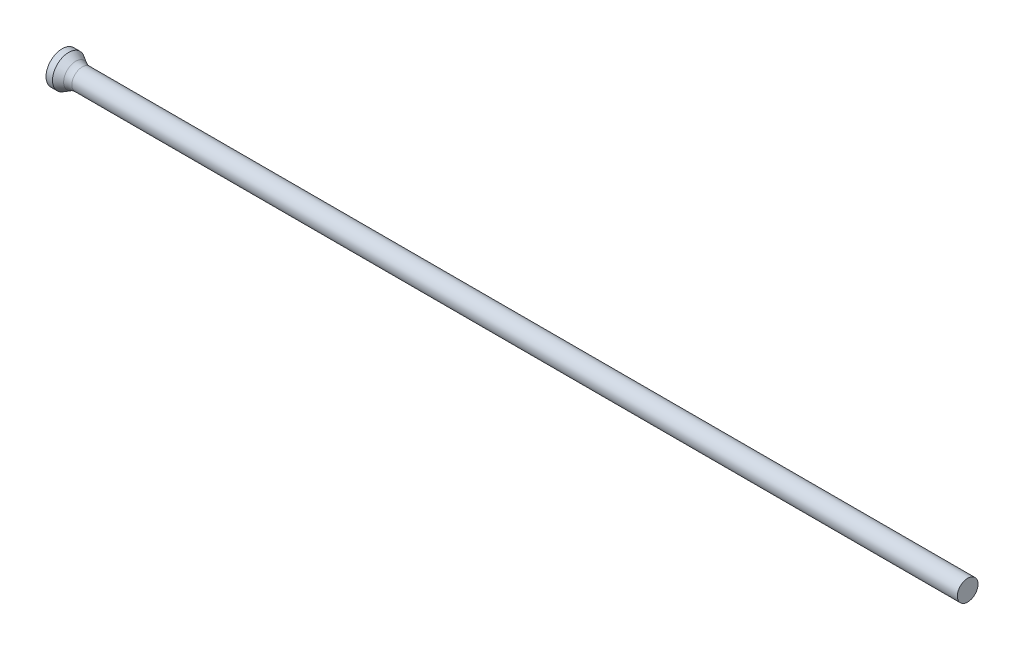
ISO-10303-21;
HEADER;
FILE_DESCRIPTION(('STEP AP214'),'2;1');
FILE_NAME('part.step','',(''),(''),'','','');
FILE_SCHEMA(('AUTOMOTIVE_DESIGN { 1 0 10303 214 1 1 1 1 }'));
ENDSEC;
DATA;
#1=APPLICATION_CONTEXT('core data for automotive mechanical design processes');
#2=APPLICATION_PROTOCOL_DEFINITION('international standard','automotive_design',2000,#1);
#3=PRODUCT_CONTEXT('',#1,'mechanical');
#4=PRODUCT('Part','Part','',(#3));
#5=PRODUCT_RELATED_PRODUCT_CATEGORY('part','',(#4));
#6=PRODUCT_DEFINITION_FORMATION('','',#4);
#7=PRODUCT_DEFINITION_CONTEXT('part definition',#1,'design');
#8=PRODUCT_DEFINITION('design','',#6,#7);
#9=PRODUCT_DEFINITION_SHAPE('','',#8);
#10=(LENGTH_UNIT() NAMED_UNIT(*) SI_UNIT(.MILLI.,.METRE.));
#11=(NAMED_UNIT(*) PLANE_ANGLE_UNIT() SI_UNIT($,.RADIAN.));
#12=(NAMED_UNIT(*) SI_UNIT($,.STERADIAN.) SOLID_ANGLE_UNIT());
#13=UNCERTAINTY_MEASURE_WITH_UNIT(LENGTH_MEASURE(1.E-05),#10,'distance_accuracy_value','');
#14=(GEOMETRIC_REPRESENTATION_CONTEXT(3) GLOBAL_UNCERTAINTY_ASSIGNED_CONTEXT((#13)) GLOBAL_UNIT_ASSIGNED_CONTEXT((#10,
#11,#12)) REPRESENTATION_CONTEXT('',''));
#15=CARTESIAN_POINT('',(0.,0.,0.));
#16=DIRECTION('',(0.,0.,1.));
#17=DIRECTION('',(1.,0.,0.));
#18=AXIS2_PLACEMENT_3D('',#15,#16,#17);
#19=CARTESIAN_POINT('',(0.,0.,0.));
#20=DIRECTION('',(1.,0.,0.));
#21=DIRECTION('',(0.,0.,-1.));
#22=AXIS2_PLACEMENT_3D('',#19,#20,#21);
#23=PLANE('',#22);
#24=CARTESIAN_POINT('',(0.,0.,0.));
#25=DIRECTION('',(-1.,0.,0.));
#26=DIRECTION('',(0.,0.,1.));
#27=AXIS2_PLACEMENT_3D('',#24,#25,#26);
#28=CIRCLE('',#27,1.25);
#29=CARTESIAN_POINT('',(0.,0.,1.25));
#30=VERTEX_POINT('',#29);
#31=EDGE_CURVE('E25',#30,#30,#28,.T.);
#32=ORIENTED_EDGE('',*,*,#31,.T.);
#33=EDGE_LOOP('',(#32));
#34=FACE_BOUND('',#33,.T.);
#35=ADVANCED_FACE('F14',(#34),#23,.F.);
#36=CARTESIAN_POINT('',(0.,0.,0.));
#37=DIRECTION('',(-1.,0.,0.));
#38=DIRECTION('',(0.,0.,1.));
#39=AXIS2_PLACEMENT_3D('',#36,#37,#38);
#40=CYLINDRICAL_SURFACE('',#39,1.25);
#41=ORIENTED_EDGE('',*,*,#31,.F.);
#42=EDGE_LOOP('',(#41));
#43=FACE_BOUND('',#42,.T.);
#44=CARTESIAN_POINT('',(0.500577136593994,0.,0.));
#45=DIRECTION('',(-1.,0.,0.));
#46=DIRECTION('',(0.,0.,1.));
#47=AXIS2_PLACEMENT_3D('',#44,#45,#46);
#48=CIRCLE('',#47,1.25);
#49=CARTESIAN_POINT('',(0.500577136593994,0.,1.25));
#50=VERTEX_POINT('',#49);
#51=EDGE_CURVE('E29',#50,#50,#48,.T.);
#52=ORIENTED_EDGE('',*,*,#51,.T.);
#53=EDGE_LOOP('',(#52));
#54=FACE_BOUND('',#53,.T.);
#55=ADVANCED_FACE('F53',(#43,#54),#40,.T.);
#56=CARTESIAN_POINT('',(1.28,0.,0.));
#57=DIRECTION('',(-1.,0.,0.));
#58=DIRECTION('',(0.,0.,1.));
#59=AXIS2_PLACEMENT_3D('',#56,#57,#58);
#60=CONICAL_SURFACE('',#59,0.8,0.523598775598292);
#61=CARTESIAN_POINT('',(1.04794919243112,0.,0.));
#62=DIRECTION('',(-1.,0.,0.));
#63=DIRECTION('',(0.,0.,1.));
#64=AXIS2_PLACEMENT_3D('',#61,#62,#63);
#65=CIRCLE('',#64,0.933974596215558);
#66=CARTESIAN_POINT('',(1.04794919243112,0.,0.933974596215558));
#67=VERTEX_POINT('',#66);
#68=EDGE_CURVE('E21',#67,#67,#65,.T.);
#69=ORIENTED_EDGE('',*,*,#68,.T.);
#70=EDGE_LOOP('',(#69));
#71=FACE_BOUND('',#70,.T.);
#72=ORIENTED_EDGE('',*,*,#51,.F.);
#73=EDGE_LOOP('',(#72));
#74=FACE_BOUND('',#73,.T.);
#75=ADVANCED_FACE('F50',(#71,#74),#60,.T.);
#76=CARTESIAN_POINT('',(0.,0.,0.));
#77=DIRECTION('',(-1.,0.,0.));
#78=DIRECTION('',(0.,0.,1.));
#79=AXIS2_PLACEMENT_3D('',#76,#77,#78);
#80=CYLINDRICAL_SURFACE('',#79,0.8);
#81=CARTESIAN_POINT('',(1.54794919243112,0.,0.));
#82=DIRECTION('',(-1.,0.,0.));
#83=DIRECTION('',(0.,0.,1.));
#84=AXIS2_PLACEMENT_3D('',#81,#82,#83);
#85=CIRCLE('',#84,0.8);
#86=CARTESIAN_POINT('',(1.54794919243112,0.,0.8));
#87=VERTEX_POINT('',#86);
#88=EDGE_CURVE('E9',#87,#87,#85,.F.);
#89=ORIENTED_EDGE('',*,*,#88,.T.);
#90=EDGE_LOOP('',(#89));
#91=FACE_BOUND('',#90,.T.);
#92=CARTESIAN_POINT('',(70.,0.,0.));
#93=DIRECTION('',(-1.,0.,0.));
#94=DIRECTION('',(0.,0.,1.));
#95=AXIS2_PLACEMENT_3D('',#92,#93,#94);
#96=CIRCLE('',#95,0.8);
#97=CARTESIAN_POINT('',(70.,0.,0.8));
#98=VERTEX_POINT('',#97);
#99=EDGE_CURVE('E34',#98,#98,#96,.T.);
#100=ORIENTED_EDGE('',*,*,#99,.T.);
#101=EDGE_LOOP('',(#100));
#102=FACE_BOUND('',#101,.T.);
#103=ADVANCED_FACE('F38',(#91,#102),#80,.T.);
#104=CARTESIAN_POINT('',(70.,0.8,0.));
#105=DIRECTION('',(-1.,0.,0.));
#106=DIRECTION('',(0.,0.,1.));
#107=AXIS2_PLACEMENT_3D('',#104,#105,#106);
#108=PLANE('',#107);
#109=ORIENTED_EDGE('',*,*,#99,.F.);
#110=EDGE_LOOP('',(#109));
#111=FACE_BOUND('',#110,.T.);
#112=ADVANCED_FACE('F40',(#111),#108,.F.);
#113=CARTESIAN_POINT('',(1.54794919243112,0.,0.));
#114=DIRECTION('',(-1.,0.,0.));
#115=DIRECTION('',(0.,0.,1.));
#116=AXIS2_PLACEMENT_3D('',#113,#114,#115);
#117=TOROIDAL_SURFACE('',#116,1.8,1.);
#118=ORIENTED_EDGE('',*,*,#88,.F.);
#119=EDGE_LOOP('',(#118));
#120=FACE_BOUND('',#119,.T.);
#121=ORIENTED_EDGE('',*,*,#68,.F.);
#122=EDGE_LOOP('',(#121));
#123=FACE_BOUND('',#122,.T.);
#124=ADVANCED_FACE('F16',(#120,#123),#117,.F.);
#125=CLOSED_SHELL('',(#35,#55,#75,#103,#112,#124));
#126=MANIFOLD_SOLID_BREP('B1',#125);
#127=ADVANCED_BREP_SHAPE_REPRESENTATION('',(#18,#126),#14);
#128=SHAPE_DEFINITION_REPRESENTATION(#9,#127);
ENDSEC;
END-ISO-10303-21;
